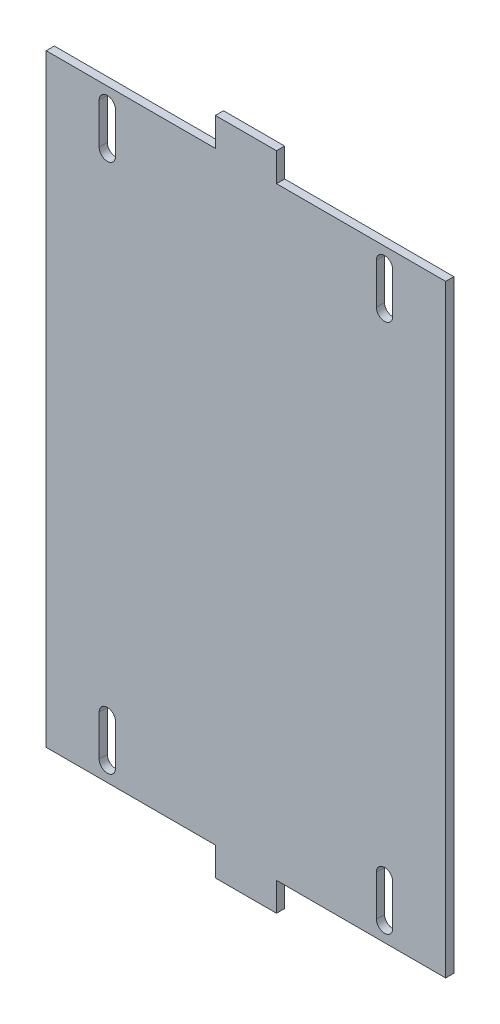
from build123d import *

# Parameters (mm, degrees)
EXTRUSION1_DEPTH                = 2
ENL_V_MAT_EXTRU_1_DEPTH         = 95.68896451
R_P_TITION_LIN_AIRE1_COUNT      = 2
R_P_TITION_LIN_AIRE1_PITCH      = 68
R_P_TITION_LIN_AIRE1_COUNT_DIR2 = 2
R_P_TITION_LIN_AIRE1_PITCH_DIR2 = 130


with BuildPart() as part:
    # Esquisse1 → Extrusion1 (new body)
    with BuildSketch(Plane.XY):
        Polygon((-49, -74), (-49, 74), (-7.5, 74), (-7.5, 81), (7.5, 81), (7.5, 74), (49, 74), (49, -74), (7.5, -74), (7.5, -81), (-7.5, -81), (-7.5, -74), align=None)
    extrude(amount=EXTRUSION1_DEPTH)

    # Esquisse2 → Enl_v. mat.-Extru.1 (cut, through all)
    with BuildSketch(Plane.XY.offset(2)):
        with BuildLine():
            Line((-36, 70), (-36, 60))
            ThreePointArc((-36, 60), (-34, 58), (-32, 60))
            Line((-32, 60), (-32, 70))
            ThreePointArc((-32, 70), (-34, 72), (-36, 70))
        make_face()
    enl_v_mat_extru_1 = extrude(amount=-ENL_V_MAT_EXTRU_1_DEPTH, mode=Mode.SUBTRACT)

    # R_p_tition lin_aire1: Enl_v. mat.-Extru.1 2 × 2
    with Locations(*[(i * R_P_TITION_LIN_AIRE1_PITCH, -j * R_P_TITION_LIN_AIRE1_PITCH_DIR2, 0) for i in range(R_P_TITION_LIN_AIRE1_COUNT) for j in range(R_P_TITION_LIN_AIRE1_COUNT_DIR2) if (i, j) != (0, 0)]):
        add(enl_v_mat_extru_1, mode=Mode.SUBTRACT)


solid = part.part
